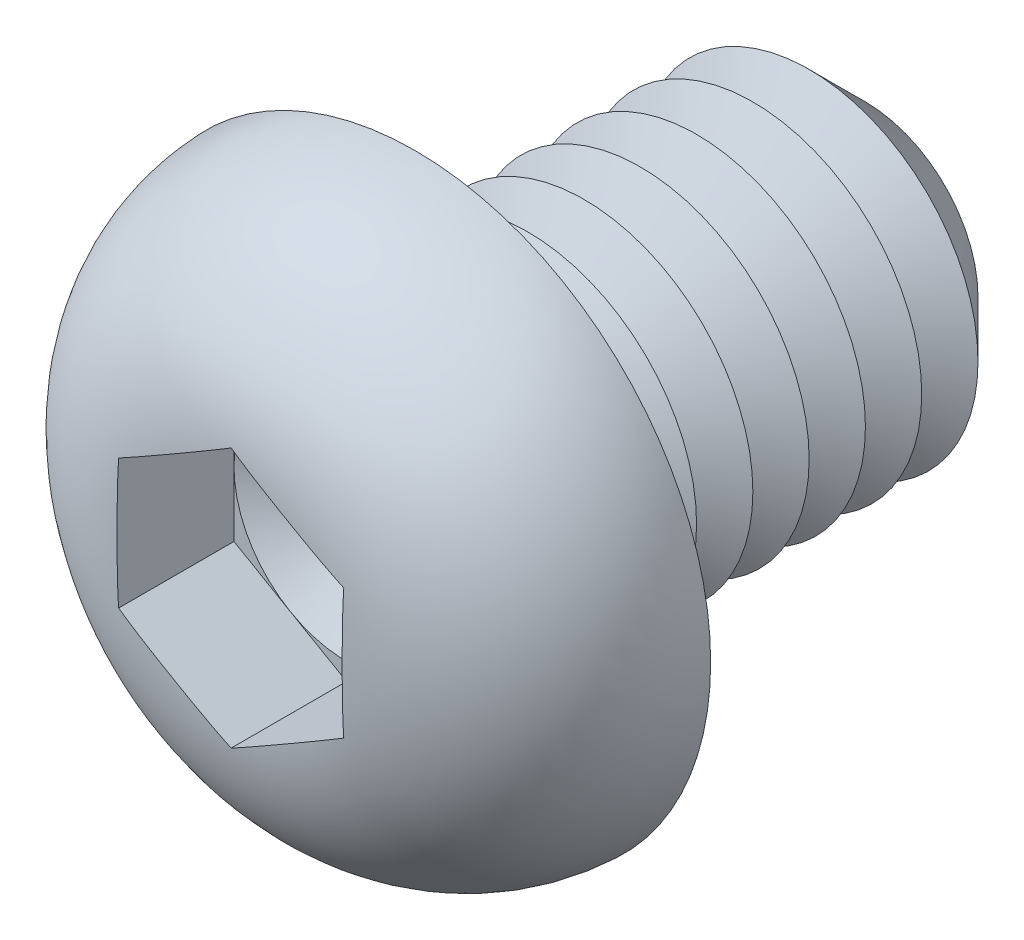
from build123d import *

# Parameters (mm, degrees)
CUT_EXTRUDE1_DEPTH  = 2.08
SKETCH4_R           = 3
BOSS_EXTRUDE1_DEPTH = 8
CHAMFER1_SIZE       = 1
LPATTERN1_COUNT     = 6
LPATTERN1_PITCH     = 1
FILLET2_R           = 0.5


with BuildPart() as part:
    # Sketch2 → Revolve1 (revolve)
    with BuildSketch(Plane(origin=(0, 0, 0), x_dir=(0, 0, -1), z_dir=(1, 0, 0)), mode=Mode.PRIVATE) as revolve1_sk:
        with BuildLine():
            Line((0, 0), (-3.3, 0))
            Line((-3.3, 0), (-3.3, 1.851470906))
            ThreePointArc((-3.3, 1.851470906), (-2.339262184, 4.220014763), (0, 5.25))
            Line((0, 5.25), (0, 0))
        make_face()
    revolve(revolve1_sk.sketch.rotate(Axis((0, 0, 47.934239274), (0, 0, -1)), 90), axis=Axis((0, 0, 47.934239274), (0, 0, -1)))

    # Sketch3 → Cut-Extrude1 (cut)
    with BuildSketch(Plane.XY.offset(3.3)):
        Polygon((0, 2.309401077), (-2, 1.154700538), (-2, -1.154700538), (0, -2.309401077), (2, -1.154700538), (2, 1.154700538), align=None)
    extrude(amount=-CUT_EXTRUDE1_DEPTH, mode=Mode.SUBTRACT)

    # Sketch4 → Boss-Extrude1 (add)
    with BuildSketch(Plane(origin=(0, 0, 0), x_dir=(-1, 0, 0), z_dir=(0, 0, -1))):
        Circle(SKETCH4_R)
    extrude(amount=BOSS_EXTRUDE1_DEPTH)

    # Chamfer1
    chamfer1_edges = [part.edges().sort_by_distance(p)[0] for p in [
        (3, 0, -8),
    ]]
    chamfer(chamfer1_edges, length=CHAMFER1_SIZE)

    # Sketch5 → Cut-Revolve1 (revolve, cut)
    with BuildSketch(Plane(origin=(0, 0, 0), x_dir=(0, 0, -1), z_dir=(1, 0, 0)), mode=Mode.PRIVATE) as cut_revolve1_sk:
        Polygon((1, 3), (2, 3), (1.5, 2.133974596), align=None)
    cut_revolve1 = revolve(cut_revolve1_sk.sketch.rotate(Axis((0, 0, 47.934239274), (0, 0, -1)), 90), axis=Axis((0, 0, 47.934239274), (0, 0, -1)), mode=Mode.SUBTRACT)

    # LPattern1: Cut-Revolve1 ×6
    with Locations(*[(0, 0, -i * LPATTERN1_PITCH) for i in range(1, LPATTERN1_COUNT)]):
        add(cut_revolve1, mode=Mode.SUBTRACT)

    # Fillet2
    fillet2_edges = [part.edges().sort_by_distance(p)[0] for p in [
        (3, 0, 0),
    ]]
    fillet(fillet2_edges, radius=FILLET2_R)

    # Cut-Extrude2 cone 1 section (on through the dimple's axis) → Cut-Extrude2 (revolve, cut)
    with BuildSketch(Plane(origin=(0, 0, 1.22), x_dir=(0, -1, 0), z_dir=(1, 0, 0))):
        Polygon((0, 0), (2, 0), (0, 1.154700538), align=None)
    revolve(axis=Axis((0, 0, 1.22), (0, 0, -1)), mode=Mode.SUBTRACT)


solid = part.part
